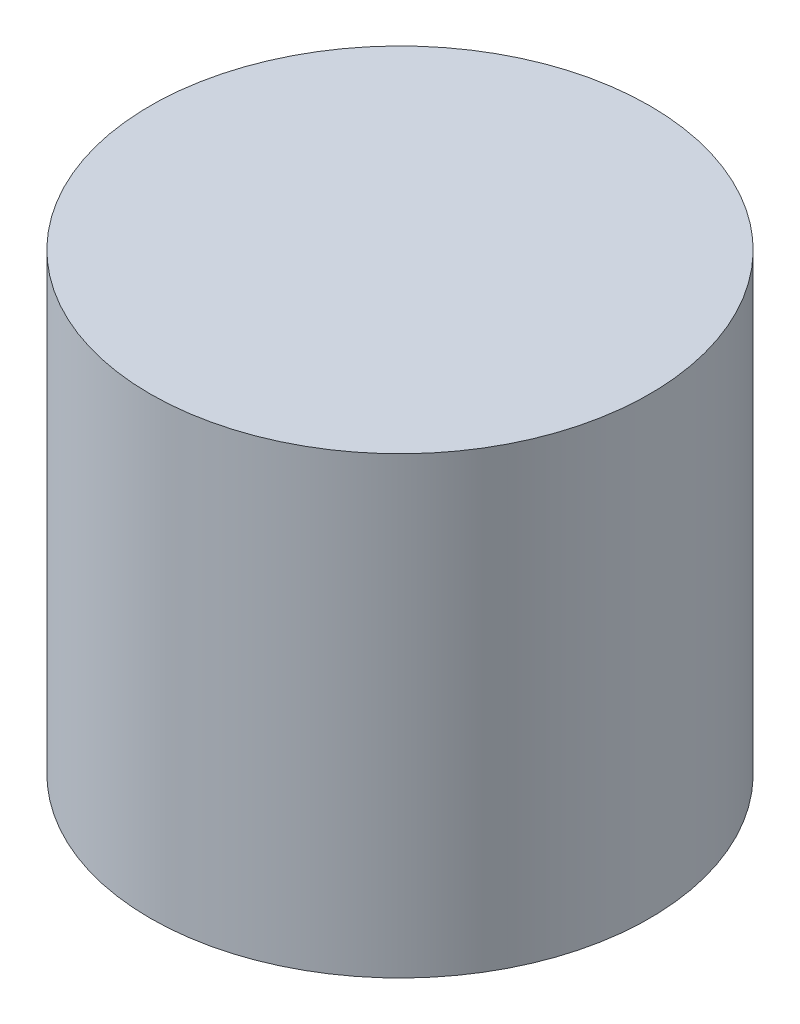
ISO-10303-21;
HEADER;
FILE_DESCRIPTION(('STEP AP214'),'2;1');
FILE_NAME('part.step','',(''),(''),'','','');
FILE_SCHEMA(('AUTOMOTIVE_DESIGN { 1 0 10303 214 1 1 1 1 }'));
ENDSEC;
DATA;
#1=APPLICATION_CONTEXT('core data for automotive mechanical design processes');
#2=APPLICATION_PROTOCOL_DEFINITION('international standard','automotive_design',2000,#1);
#3=PRODUCT_CONTEXT('',#1,'mechanical');
#4=PRODUCT('Part','Part','',(#3));
#5=PRODUCT_RELATED_PRODUCT_CATEGORY('part','',(#4));
#6=PRODUCT_DEFINITION_FORMATION('','',#4);
#7=PRODUCT_DEFINITION_CONTEXT('part definition',#1,'design');
#8=PRODUCT_DEFINITION('design','',#6,#7);
#9=PRODUCT_DEFINITION_SHAPE('','',#8);
#10=(LENGTH_UNIT() NAMED_UNIT(*) SI_UNIT(.MILLI.,.METRE.));
#11=(NAMED_UNIT(*) PLANE_ANGLE_UNIT() SI_UNIT($,.RADIAN.));
#12=(NAMED_UNIT(*) SI_UNIT($,.STERADIAN.) SOLID_ANGLE_UNIT());
#13=UNCERTAINTY_MEASURE_WITH_UNIT(LENGTH_MEASURE(1.E-05),#10,'distance_accuracy_value','');
#14=(GEOMETRIC_REPRESENTATION_CONTEXT(3) GLOBAL_UNCERTAINTY_ASSIGNED_CONTEXT((#13)) GLOBAL_UNIT_ASSIGNED_CONTEXT((#10,
#11,#12)) REPRESENTATION_CONTEXT('',''));
#15=CARTESIAN_POINT('',(0.,0.,0.));
#16=DIRECTION('',(0.,0.,1.));
#17=DIRECTION('',(1.,0.,0.));
#18=AXIS2_PLACEMENT_3D('',#15,#16,#17);
#19=CARTESIAN_POINT('',(0.,40.,0.));
#20=DIRECTION('',(0.,-1.,0.));
#21=DIRECTION('',(0.,0.,-1.));
#22=AXIS2_PLACEMENT_3D('',#19,#20,#21);
#23=CYLINDRICAL_SURFACE('',#22,22.);
#24=CARTESIAN_POINT('',(0.,40.,0.));
#25=DIRECTION('',(0.,1.,0.));
#26=DIRECTION('',(0.,0.,1.));
#27=AXIS2_PLACEMENT_3D('',#24,#25,#26);
#28=CIRCLE('',#27,22.);
#29=CARTESIAN_POINT('',(0.,40.,22.));
#30=VERTEX_POINT('',#29);
#31=EDGE_CURVE('E10',#30,#30,#28,.T.);
#32=ORIENTED_EDGE('',*,*,#31,.F.);
#33=EDGE_LOOP('',(#32));
#34=FACE_BOUND('',#33,.T.);
#35=CARTESIAN_POINT('',(0.,0.,0.));
#36=DIRECTION('',(0.,1.,0.));
#37=DIRECTION('',(0.,0.,1.));
#38=AXIS2_PLACEMENT_3D('',#35,#36,#37);
#39=CIRCLE('',#38,22.);
#40=CARTESIAN_POINT('',(0.,0.,22.));
#41=VERTEX_POINT('',#40);
#42=EDGE_CURVE('E42',#41,#41,#39,.T.);
#43=ORIENTED_EDGE('',*,*,#42,.T.);
#44=EDGE_LOOP('',(#43));
#45=FACE_BOUND('',#44,.T.);
#46=ADVANCED_FACE('F39',(#34,#45),#23,.T.);
#47=CARTESIAN_POINT('',(0.,40.,0.));
#48=DIRECTION('',(0.,1.,0.));
#49=DIRECTION('',(0.,0.,1.));
#50=AXIS2_PLACEMENT_3D('',#47,#48,#49);
#51=PLANE('',#50);
#52=ORIENTED_EDGE('',*,*,#31,.T.);
#53=EDGE_LOOP('',(#52));
#54=FACE_BOUND('',#53,.T.);
#55=ADVANCED_FACE('F54',(#54),#51,.T.);
#56=CARTESIAN_POINT('',(0.,0.,0.));
#57=DIRECTION('',(0.,1.,0.));
#58=DIRECTION('',(0.,0.,1.));
#59=AXIS2_PLACEMENT_3D('',#56,#57,#58);
#60=PLANE('',#59);
#61=ORIENTED_EDGE('',*,*,#42,.F.);
#62=EDGE_LOOP('',(#61));
#63=FACE_BOUND('',#62,.T.);
#64=ADVANCED_FACE('F52',(#63),#60,.F.);
#65=CLOSED_SHELL('',(#46,#55,#64));
#66=MANIFOLD_SOLID_BREP('B2',#65);
#67=ADVANCED_BREP_SHAPE_REPRESENTATION('',(#18,#66),#14);
#68=SHAPE_DEFINITION_REPRESENTATION(#9,#67);
ENDSEC;
END-ISO-10303-21;
